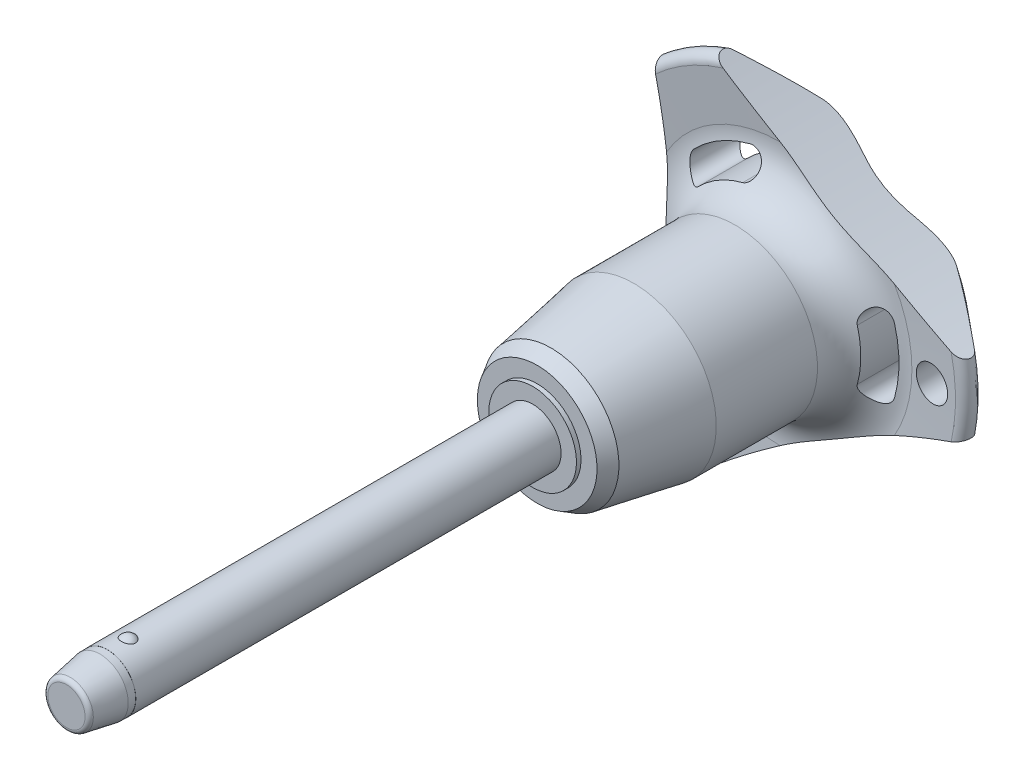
from build123d import *

# Parameters (mm, degrees)
SKETCH1_R           = 2.5
BOSS_EXTRUDE1_DEPTH = 35
SKETCH2_R           = 2.1
BOSS_EXTRUDE2_DEPTH = 26.7
BOSS_EXTRUDE3_START = 6
SKETCH1_2_R         = 2.5
BOSS_EXTRUDE3_DEPTH = 6
CHAMFER1_SIZE       = 3
CHAMFER1_SIZE2      = 0.528980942
FILLET1_R           = 0.4
SKETCH6_R           = 79.96
CUT_EXTRUDE1_DEPTH  = 67.015920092
CIRPATTERN1_COUNT   = 3
SKETCH7_R           = 1.5
CUT_EXTRUDE2_DEPTH  = 66.784951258
SKETCH8_R           = 2.5
SKETCH8_R_2         = 2.49
CUT_EXTRUDE3_DEPTH  = 3.6


with BuildPart() as part:
    # Sketch1 → Boss-Extrude1 (new body)
    with BuildSketch(Plane.XY):
        Circle(SKETCH1_R)
    extrude(amount=-BOSS_EXTRUDE1_DEPTH)

    # Sketch2 → Boss-Extrude2 (add)
    with BuildSketch(Plane(origin=(0, 0, -35), x_dir=(-1, 0, 0), z_dir=(0, 0, -1))):
        Circle(SKETCH2_R)
    extrude(amount=BOSS_EXTRUDE2_DEPTH)

    # Sketch3 → Revolve1 (revolve)
    with BuildSketch(Plane(origin=(0, 0, 0), x_dir=(0, 0, -1), z_dir=(1, 0, 0))):
        with BuildLine():
            Line((-0.580947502, 2.75), (-0.580947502, 1.15))
            ThreePointArc((-0.580947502, 1.15), (0.219052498, 1.95), (-0.580947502, 2.75))
        make_face()
        with BuildLine():
            Line((-0.580947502, -1.15), (-0.580947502, -2.75))
            ThreePointArc((-0.580947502, -2.75), (0.219052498, -1.95), (-0.580947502, -1.15))
        make_face()
    revolve(axis=Axis((0, -1.15, 0.580947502), (0, 1, 0)))

    # Sketch1_2 → Boss-Extrude3 (add)
    with BuildSketch(Plane.XY.offset(BOSS_EXTRUDE3_START)):
        Circle(SKETCH1_2_R)
    extrude(amount=-BOSS_EXTRUDE3_DEPTH)

    # Chamfer1
    chamfer1_edges = [part.edges().sort_by_distance(p)[0] for p in [
        (-2.5, 0, 6),
    ]]
    chamfer1_side = [part.faces().sort_by_distance(p)[0] for p in [
        (-2.5, 0, -14.5),
    ]]
    chamfer(chamfer1_edges, length=CHAMFER1_SIZE, length2=CHAMFER1_SIZE2, reference=chamfer1_side[0])

    # Fillet1
    fillet1_edges = [part.edges().sort_by_distance(p)[0] for p in [
        (-1.971019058, 0, 6),
        (2.1, 0, -61.7),
    ]]
    fillet(fillet1_edges, radius=FILLET1_R)

    # Sketch4 → Revolve2 (revolve)
    with BuildSketch(Plane(origin=(0, 0, 0), x_dir=(0, 0, -1), z_dir=(1, 0, 0)), mode=Mode.PRIVATE) as revolve2_sk:
        Polygon((35, 0), (35, 3.851837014), (35.4, 3.851837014), (35.4, 5.26161122), (36.620900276, 5.966498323), (43.9, 7.25), (52.8, 7.25), (52.8, 0), align=None)
    revolve(revolve2_sk.sketch.rotate(Axis((0, 0, -52.8), (0, 0, 1)), 90), axis=Axis((0, 0, -52.8), (0, 0, 1)))

    # Sketch5 → Revolve3 (revolve)
    with BuildSketch(Plane(origin=(0, 0, 0), x_dir=(0, 0, -1), z_dir=(1, 0, 0)), mode=Mode.PRIVATE) as revolve3_sk:
        with BuildLine():
            Line((56.78715932, 11.570250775), (56.452568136, 15.735949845))
            ThreePointArc((56.452568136, 15.735949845), (56.946485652, 16.540188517), (57.862835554, 16.314230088))
            Line((57.862835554, 16.314230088), (61.326414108, 12.186497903))
            ThreePointArc((61.326414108, 12.186497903), (61.7, 11.109282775), (61.261488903, 10.056825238))
            ThreePointArc((61.261488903, 10.056825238), (58.289873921, 5.413681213), (57.25, 0))
            Line((57.25, 0), (52.8, 0))
            Line((52.8, 0), (52.8, 7.25))
            ThreePointArc((52.8, 7.25), (55.739473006, 8.537160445), (56.78715932, 11.570250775))
        make_face()
    revolve(revolve3_sk.sketch.rotate(Axis((0, 0, -57.25), (0, 0, 1)), 90), axis=Axis((0, 0, -57.25), (0, 0, 1)))

    # Sketch6 → Cut-Extrude1 (cut, through all)
    with BuildSketch(Plane.XY):
        with Locations((-89.76, 0)):
            Circle(SKETCH6_R)
        with BuildLine():
            ThreePointArc((10.099921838, -2.834717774), (10.490188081, 0), (10.099921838, 2.834717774))
            ThreePointArc((10.099921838, 2.834717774), (8.768180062, 3.582738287), (8.020159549, 2.250996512))
            ThreePointArc((8.020159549, 2.250996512), (8.330062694, 0), (8.020159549, -2.250996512))
            ThreePointArc((8.020159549, -2.250996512), (8.768180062, -3.582738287), (10.099921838, -2.834717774))
        make_face()
    cut_extrude1 = extrude(amount=-CUT_EXTRUDE1_DEPTH, mode=Mode.SUBTRACT)

    # CirPattern1: Cut-Extrude1 ×3 about axis
    cirpattern1_axis = Axis((0, 0, 0), (0, 0, 1))
    for i in range(1, CIRPATTERN1_COUNT):
        add(cut_extrude1.rotate(cirpattern1_axis, i * 360 / CIRPATTERN1_COUNT), mode=Mode.SUBTRACT)

    # Sketch7 → Cut-Extrude2 (cut, through all)
    with BuildSketch(Plane.XY):
        with Locations(Location((13.490188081, 0, 0), (0, 0, 225.221865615))):
            Circle(SKETCH7_R)
    extrude(amount=-CUT_EXTRUDE2_DEPTH, mode=Mode.SUBTRACT)

    # Sketch8 → Cut-Extrude3 (cut)
    with BuildSketch(Plane.XY.offset(6)):
        Circle(SKETCH8_R)
        Circle(SKETCH8_R_2, mode=Mode.SUBTRACT)
    extrude(amount=-CUT_EXTRUDE3_DEPTH, mode=Mode.SUBTRACT)


solid = part.part
